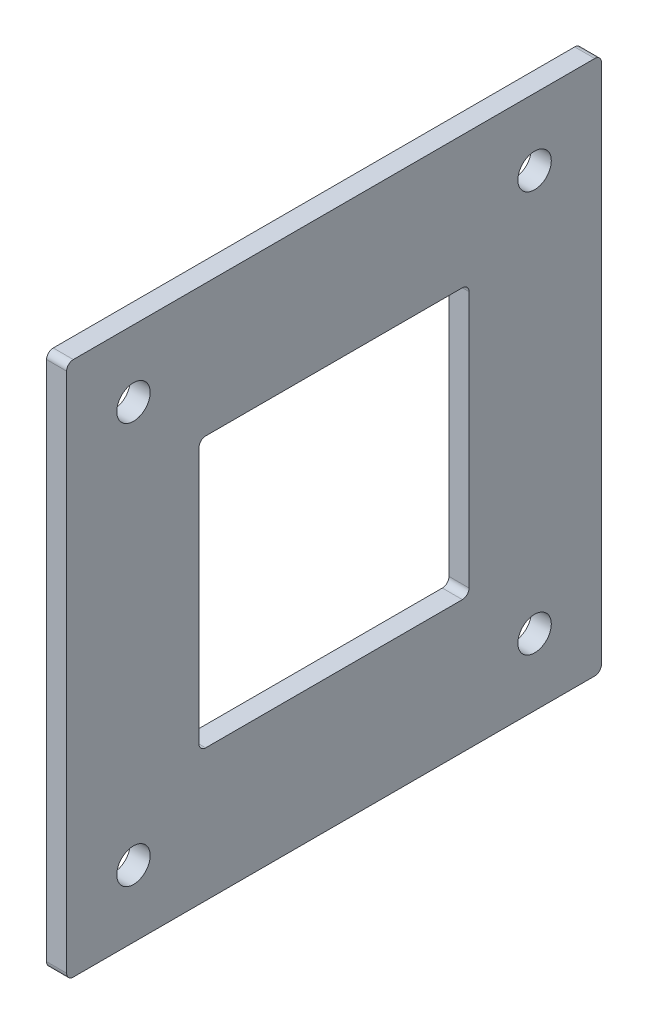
ISO-10303-21;
HEADER;
FILE_DESCRIPTION(('STEP AP214'),'2;1');
FILE_NAME('part.step','',(''),(''),'','','');
FILE_SCHEMA(('AUTOMOTIVE_DESIGN { 1 0 10303 214 1 1 1 1 }'));
ENDSEC;
DATA;
#1=APPLICATION_CONTEXT('core data for automotive mechanical design processes');
#2=APPLICATION_PROTOCOL_DEFINITION('international standard','automotive_design',2000,#1);
#3=PRODUCT_CONTEXT('',#1,'mechanical');
#4=PRODUCT('Part','Part','',(#3));
#5=PRODUCT_RELATED_PRODUCT_CATEGORY('part','',(#4));
#6=PRODUCT_DEFINITION_FORMATION('','',#4);
#7=PRODUCT_DEFINITION_CONTEXT('part definition',#1,'design');
#8=PRODUCT_DEFINITION('design','',#6,#7);
#9=PRODUCT_DEFINITION_SHAPE('','',#8);
#10=(LENGTH_UNIT() NAMED_UNIT(*) SI_UNIT(.MILLI.,.METRE.));
#11=(NAMED_UNIT(*) PLANE_ANGLE_UNIT() SI_UNIT($,.RADIAN.));
#12=(NAMED_UNIT(*) SI_UNIT($,.STERADIAN.) SOLID_ANGLE_UNIT());
#13=UNCERTAINTY_MEASURE_WITH_UNIT(LENGTH_MEASURE(1.E-05),#10,'distance_accuracy_value','');
#14=(GEOMETRIC_REPRESENTATION_CONTEXT(3) GLOBAL_UNCERTAINTY_ASSIGNED_CONTEXT((#13)) GLOBAL_UNIT_ASSIGNED_CONTEXT((#10,
#11,#12)) REPRESENTATION_CONTEXT('',''));
#15=CARTESIAN_POINT('',(0.,0.,0.));
#16=DIRECTION('',(0.,0.,1.));
#17=DIRECTION('',(1.,0.,0.));
#18=AXIS2_PLACEMENT_3D('',#15,#16,#17);
#19=CARTESIAN_POINT('',(0.,0.,0.));
#20=DIRECTION('',(-1.,0.,0.));
#21=DIRECTION('',(0.,0.,1.));
#22=AXIS2_PLACEMENT_3D('',#19,#20,#21);
#23=PLANE('',#22);
#24=CARTESIAN_POINT('',(0.,30.,30.));
#25=DIRECTION('',(1.,0.,0.));
#26=DIRECTION('',(0.,0.,-1.));
#27=AXIS2_PLACEMENT_3D('',#24,#25,#26);
#28=CIRCLE('',#27,2.49999999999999);
#29=CARTESIAN_POINT('',(0.,30.,27.5));
#30=VERTEX_POINT('',#29);
#31=EDGE_CURVE('E588',#30,#30,#28,.T.);
#32=ORIENTED_EDGE('',*,*,#31,.F.);
#33=EDGE_LOOP('',(#32));
#34=FACE_BOUND('',#33,.T.);
#35=CARTESIAN_POINT('',(0.,30.,-30.));
#36=DIRECTION('',(1.,0.,0.));
#37=DIRECTION('',(0.,0.,-1.));
#38=AXIS2_PLACEMENT_3D('',#35,#36,#37);
#39=CIRCLE('',#38,2.49999999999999);
#40=CARTESIAN_POINT('',(0.,30.,-32.5));
#41=VERTEX_POINT('',#40);
#42=EDGE_CURVE('E584',#41,#41,#39,.T.);
#43=ORIENTED_EDGE('',*,*,#42,.F.);
#44=EDGE_LOOP('',(#43));
#45=FACE_BOUND('',#44,.T.);
#46=DIRECTION('',(0.,0.,-1.));
#47=VECTOR('',#46,1.);
#48=CARTESIAN_POINT('',(0.,-40.,40.));
#49=LINE('',#48,#47);
#50=CARTESIAN_POINT('',(0.,-40.,39.));
#51=VERTEX_POINT('',#50);
#52=CARTESIAN_POINT('',(0.,-40.,-39.));
#53=VERTEX_POINT('',#52);
#54=EDGE_CURVE('E163',#51,#53,#49,.T.);
#55=ORIENTED_EDGE('',*,*,#54,.T.);
#56=CARTESIAN_POINT('',(0.,-39.,-39.));
#57=DIRECTION('',(-1.,0.,0.));
#58=DIRECTION('',(0.,0.,1.));
#59=AXIS2_PLACEMENT_3D('',#56,#57,#58);
#60=CIRCLE('',#59,1.);
#61=CARTESIAN_POINT('',(0.,-39.,-40.));
#62=VERTEX_POINT('',#61);
#63=EDGE_CURVE('E170',#53,#62,#60,.F.);
#64=ORIENTED_EDGE('',*,*,#63,.T.);
#65=DIRECTION('',(0.,1.,0.));
#66=VECTOR('',#65,1.);
#67=CARTESIAN_POINT('',(0.,-40.,-40.));
#68=LINE('',#67,#66);
#69=CARTESIAN_POINT('',(0.,39.,-40.));
#70=VERTEX_POINT('',#69);
#71=EDGE_CURVE('E280',#62,#70,#68,.T.);
#72=ORIENTED_EDGE('',*,*,#71,.T.);
#73=CARTESIAN_POINT('',(0.,39.,-39.));
#74=DIRECTION('',(-1.,0.,0.));
#75=DIRECTION('',(0.,0.,1.));
#76=AXIS2_PLACEMENT_3D('',#73,#74,#75);
#77=CIRCLE('',#76,1.);
#78=CARTESIAN_POINT('',(0.,40.,-39.));
#79=VERTEX_POINT('',#78);
#80=EDGE_CURVE('E188',#70,#79,#77,.F.);
#81=ORIENTED_EDGE('',*,*,#80,.T.);
#82=DIRECTION('',(0.,0.,1.));
#83=VECTOR('',#82,1.);
#84=CARTESIAN_POINT('',(0.,40.,40.));
#85=LINE('',#84,#83);
#86=CARTESIAN_POINT('',(0.,40.,39.));
#87=VERTEX_POINT('',#86);
#88=EDGE_CURVE('E296',#79,#87,#85,.T.);
#89=ORIENTED_EDGE('',*,*,#88,.T.);
#90=CARTESIAN_POINT('',(0.,39.,39.));
#91=DIRECTION('',(-1.,0.,0.));
#92=DIRECTION('',(0.,0.,1.));
#93=AXIS2_PLACEMENT_3D('',#90,#91,#92);
#94=CIRCLE('',#93,1.);
#95=CARTESIAN_POINT('',(0.,39.,40.));
#96=VERTEX_POINT('',#95);
#97=EDGE_CURVE('E171',#87,#96,#94,.F.);
#98=ORIENTED_EDGE('',*,*,#97,.T.);
#99=DIRECTION('',(0.,-1.,0.));
#100=VECTOR('',#99,1.);
#101=CARTESIAN_POINT('',(0.,-40.,40.));
#102=LINE('',#101,#100);
#103=CARTESIAN_POINT('',(0.,-39.,40.));
#104=VERTEX_POINT('',#103);
#105=EDGE_CURVE('E165',#96,#104,#102,.T.);
#106=ORIENTED_EDGE('',*,*,#105,.T.);
#107=CARTESIAN_POINT('',(0.,-39.,39.));
#108=DIRECTION('',(-1.,0.,0.));
#109=DIRECTION('',(0.,0.,1.));
#110=AXIS2_PLACEMENT_3D('',#107,#108,#109);
#111=CIRCLE('',#110,1.);
#112=EDGE_CURVE('E160',#104,#51,#111,.F.);
#113=ORIENTED_EDGE('',*,*,#112,.T.);
#114=EDGE_LOOP('',(#55,#64,#72,#81,#89,#98,#106,#113));
#115=FACE_BOUND('',#114,.T.);
#116=DIRECTION('',(0.,0.,1.));
#117=VECTOR('',#116,1.);
#118=CARTESIAN_POINT('',(0.,20.2,20.2));
#119=LINE('',#118,#117);
#120=CARTESIAN_POINT('',(0.,20.2,-19.2));
#121=VERTEX_POINT('',#120);
#122=CARTESIAN_POINT('',(0.,20.2,19.2));
#123=VERTEX_POINT('',#122);
#124=EDGE_CURVE('E282',#121,#123,#119,.T.);
#125=ORIENTED_EDGE('',*,*,#124,.F.);
#126=CARTESIAN_POINT('',(0.,19.2,-19.2));
#127=DIRECTION('',(-1.,0.,0.));
#128=DIRECTION('',(0.,0.,1.));
#129=AXIS2_PLACEMENT_3D('',#126,#127,#128);
#130=CIRCLE('',#129,1.);
#131=CARTESIAN_POINT('',(0.,19.2,-20.2));
#132=VERTEX_POINT('',#131);
#133=EDGE_CURVE('E245',#121,#132,#130,.T.);
#134=ORIENTED_EDGE('',*,*,#133,.T.);
#135=DIRECTION('',(0.,1.,0.));
#136=VECTOR('',#135,1.);
#137=CARTESIAN_POINT('',(0.,-20.2,-20.2));
#138=LINE('',#137,#136);
#139=CARTESIAN_POINT('',(0.,-19.2,-20.2));
#140=VERTEX_POINT('',#139);
#141=EDGE_CURVE('E254',#140,#132,#138,.T.);
#142=ORIENTED_EDGE('',*,*,#141,.F.);
#143=CARTESIAN_POINT('',(0.,-19.2,-19.2));
#144=DIRECTION('',(-1.,0.,0.));
#145=DIRECTION('',(0.,0.,1.));
#146=AXIS2_PLACEMENT_3D('',#143,#144,#145);
#147=CIRCLE('',#146,1.);
#148=CARTESIAN_POINT('',(0.,-20.2,-19.2));
#149=VERTEX_POINT('',#148);
#150=EDGE_CURVE('E55',#140,#149,#147,.T.);
#151=ORIENTED_EDGE('',*,*,#150,.T.);
#152=DIRECTION('',(0.,0.,-1.));
#153=VECTOR('',#152,1.);
#154=CARTESIAN_POINT('',(0.,-20.2,20.2));
#155=LINE('',#154,#153);
#156=CARTESIAN_POINT('',(0.,-20.2,19.2));
#157=VERTEX_POINT('',#156);
#158=EDGE_CURVE('E253',#157,#149,#155,.T.);
#159=ORIENTED_EDGE('',*,*,#158,.F.);
#160=CARTESIAN_POINT('',(0.,-19.2,19.2));
#161=DIRECTION('',(-1.,0.,0.));
#162=DIRECTION('',(0.,0.,1.));
#163=AXIS2_PLACEMENT_3D('',#160,#161,#162);
#164=CIRCLE('',#163,1.);
#165=CARTESIAN_POINT('',(0.,-19.2,20.2));
#166=VERTEX_POINT('',#165);
#167=EDGE_CURVE('E237',#157,#166,#164,.T.);
#168=ORIENTED_EDGE('',*,*,#167,.T.);
#169=DIRECTION('',(0.,-1.,0.));
#170=VECTOR('',#169,1.);
#171=CARTESIAN_POINT('',(0.,-20.2,20.2));
#172=LINE('',#171,#170);
#173=CARTESIAN_POINT('',(0.,19.2,20.2));
#174=VERTEX_POINT('',#173);
#175=EDGE_CURVE('E263',#174,#166,#172,.T.);
#176=ORIENTED_EDGE('',*,*,#175,.F.);
#177=CARTESIAN_POINT('',(0.,19.2,19.2));
#178=DIRECTION('',(-1.,0.,0.));
#179=DIRECTION('',(0.,0.,1.));
#180=AXIS2_PLACEMENT_3D('',#177,#178,#179);
#181=CIRCLE('',#180,1.);
#182=EDGE_CURVE('E241',#174,#123,#181,.T.);
#183=ORIENTED_EDGE('',*,*,#182,.T.);
#184=EDGE_LOOP('',(#125,#134,#142,#151,#159,#168,#176,#183));
#185=FACE_BOUND('',#184,.T.);
#186=CARTESIAN_POINT('',(0.,-30.,30.));
#187=DIRECTION('',(1.,0.,0.));
#188=DIRECTION('',(0.,0.,-1.));
#189=AXIS2_PLACEMENT_3D('',#186,#187,#188);
#190=CIRCLE('',#189,2.49999999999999);
#191=CARTESIAN_POINT('',(0.,-30.,27.5));
#192=VERTEX_POINT('',#191);
#193=EDGE_CURVE('E575',#192,#192,#190,.T.);
#194=ORIENTED_EDGE('',*,*,#193,.F.);
#195=EDGE_LOOP('',(#194));
#196=FACE_BOUND('',#195,.T.);
#197=CARTESIAN_POINT('',(0.,-30.,-30.));
#198=DIRECTION('',(1.,0.,0.));
#199=DIRECTION('',(0.,0.,-1.));
#200=AXIS2_PLACEMENT_3D('',#197,#198,#199);
#201=CIRCLE('',#200,2.49999999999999);
#202=CARTESIAN_POINT('',(0.,-30.,-32.5));
#203=VERTEX_POINT('',#202);
#204=EDGE_CURVE('E578',#203,#203,#201,.T.);
#205=ORIENTED_EDGE('',*,*,#204,.F.);
#206=EDGE_LOOP('',(#205));
#207=FACE_BOUND('',#206,.T.);
#208=ADVANCED_FACE('F47',(#34,#45,#115,#185,#196,#207),#23,.F.);
#209=CARTESIAN_POINT('',(-3.,-40.,-40.));
#210=DIRECTION('',(0.,0.,-1.));
#211=DIRECTION('',(-1.,0.,0.));
#212=AXIS2_PLACEMENT_3D('',#209,#210,#211);
#213=PLANE('',#212);
#214=ORIENTED_EDGE('',*,*,#71,.F.);
#215=DIRECTION('',(1.,0.,0.));
#216=VECTOR('',#215,1.);
#217=CARTESIAN_POINT('',(-3.,-39.,-40.));
#218=LINE('',#217,#216);
#219=CARTESIAN_POINT('',(-3.,-39.,-40.));
#220=VERTEX_POINT('',#219);
#221=EDGE_CURVE('E200',#62,#220,#218,.F.);
#222=ORIENTED_EDGE('',*,*,#221,.T.);
#223=DIRECTION('',(0.,1.,0.));
#224=VECTOR('',#223,1.);
#225=CARTESIAN_POINT('',(-3.,-40.,-40.));
#226=LINE('',#225,#224);
#227=CARTESIAN_POINT('',(-3.,39.,-40.));
#228=VERTEX_POINT('',#227);
#229=EDGE_CURVE('E181',#220,#228,#226,.T.);
#230=ORIENTED_EDGE('',*,*,#229,.T.);
#231=DIRECTION('',(1.,0.,0.));
#232=VECTOR('',#231,1.);
#233=CARTESIAN_POINT('',(-3.,39.,-40.));
#234=LINE('',#233,#232);
#235=EDGE_CURVE('E197',#228,#70,#234,.T.);
#236=ORIENTED_EDGE('',*,*,#235,.T.);
#237=EDGE_LOOP('',(#214,#222,#230,#236));
#238=FACE_BOUND('',#237,.T.);
#239=ADVANCED_FACE('F314',(#238),#213,.T.);
#240=CARTESIAN_POINT('',(-3.,-40.,40.));
#241=DIRECTION('',(0.,-1.,0.));
#242=DIRECTION('',(0.,0.,-1.));
#243=AXIS2_PLACEMENT_3D('',#240,#241,#242);
#244=PLANE('',#243);
#245=DIRECTION('',(0.,0.,-1.));
#246=VECTOR('',#245,1.);
#247=CARTESIAN_POINT('',(-3.,-40.,40.));
#248=LINE('',#247,#246);
#249=CARTESIAN_POINT('',(-3.,-40.,39.));
#250=VERTEX_POINT('',#249);
#251=CARTESIAN_POINT('',(-3.,-40.,-39.));
#252=VERTEX_POINT('',#251);
#253=EDGE_CURVE('E186',#250,#252,#248,.T.);
#254=ORIENTED_EDGE('',*,*,#253,.T.);
#255=DIRECTION('',(1.,0.,0.));
#256=VECTOR('',#255,1.);
#257=CARTESIAN_POINT('',(-3.,-40.,-39.));
#258=LINE('',#257,#256);
#259=EDGE_CURVE('E180',#252,#53,#258,.T.);
#260=ORIENTED_EDGE('',*,*,#259,.T.);
#261=ORIENTED_EDGE('',*,*,#54,.F.);
#262=DIRECTION('',(1.,0.,0.));
#263=VECTOR('',#262,1.);
#264=CARTESIAN_POINT('',(-3.,-40.,39.));
#265=LINE('',#264,#263);
#266=EDGE_CURVE('E177',#51,#250,#265,.F.);
#267=ORIENTED_EDGE('',*,*,#266,.T.);
#268=EDGE_LOOP('',(#254,#260,#261,#267));
#269=FACE_BOUND('',#268,.T.);
#270=ADVANCED_FACE('F176',(#269),#244,.T.);
#271=CARTESIAN_POINT('',(-3.,-40.,40.));
#272=DIRECTION('',(0.,0.,1.));
#273=DIRECTION('',(1.,0.,0.));
#274=AXIS2_PLACEMENT_3D('',#271,#272,#273);
#275=PLANE('',#274);
#276=DIRECTION('',(0.,-1.,0.));
#277=VECTOR('',#276,1.);
#278=CARTESIAN_POINT('',(-3.,-40.,40.));
#279=LINE('',#278,#277);
#280=CARTESIAN_POINT('',(-3.,39.,40.));
#281=VERTEX_POINT('',#280);
#282=CARTESIAN_POINT('',(-3.,-39.,40.));
#283=VERTEX_POINT('',#282);
#284=EDGE_CURVE('E190',#281,#283,#279,.T.);
#285=ORIENTED_EDGE('',*,*,#284,.T.);
#286=DIRECTION('',(1.,0.,0.));
#287=VECTOR('',#286,1.);
#288=CARTESIAN_POINT('',(-3.,-39.,40.));
#289=LINE('',#288,#287);
#290=EDGE_CURVE('E211',#283,#104,#289,.T.);
#291=ORIENTED_EDGE('',*,*,#290,.T.);
#292=ORIENTED_EDGE('',*,*,#105,.F.);
#293=DIRECTION('',(1.,0.,0.));
#294=VECTOR('',#293,1.);
#295=CARTESIAN_POINT('',(-3.,39.,40.));
#296=LINE('',#295,#294);
#297=EDGE_CURVE('E209',#96,#281,#296,.F.);
#298=ORIENTED_EDGE('',*,*,#297,.T.);
#299=EDGE_LOOP('',(#285,#291,#292,#298));
#300=FACE_BOUND('',#299,.T.);
#301=ADVANCED_FACE('F321',(#300),#275,.T.);
#302=CARTESIAN_POINT('',(-3.,40.,40.));
#303=DIRECTION('',(0.,1.,0.));
#304=DIRECTION('',(0.,0.,1.));
#305=AXIS2_PLACEMENT_3D('',#302,#303,#304);
#306=PLANE('',#305);
#307=DIRECTION('',(0.,0.,1.));
#308=VECTOR('',#307,1.);
#309=CARTESIAN_POINT('',(-3.,40.,40.));
#310=LINE('',#309,#308);
#311=CARTESIAN_POINT('',(-3.,40.,-39.));
#312=VERTEX_POINT('',#311);
#313=CARTESIAN_POINT('',(-3.,40.,39.));
#314=VERTEX_POINT('',#313);
#315=EDGE_CURVE('E289',#312,#314,#310,.T.);
#316=ORIENTED_EDGE('',*,*,#315,.T.);
#317=DIRECTION('',(1.,0.,0.));
#318=VECTOR('',#317,1.);
#319=CARTESIAN_POINT('',(-3.,40.,39.));
#320=LINE('',#319,#318);
#321=EDGE_CURVE('E215',#314,#87,#320,.T.);
#322=ORIENTED_EDGE('',*,*,#321,.T.);
#323=ORIENTED_EDGE('',*,*,#88,.F.);
#324=DIRECTION('',(1.,0.,0.));
#325=VECTOR('',#324,1.);
#326=CARTESIAN_POINT('',(-3.,40.,-39.));
#327=LINE('',#326,#325);
#328=EDGE_CURVE('E213',#79,#312,#327,.F.);
#329=ORIENTED_EDGE('',*,*,#328,.T.);
#330=EDGE_LOOP('',(#316,#322,#323,#329));
#331=FACE_BOUND('',#330,.T.);
#332=ADVANCED_FACE('F301',(#331),#306,.T.);
#333=CARTESIAN_POINT('',(-3.,0.,0.));
#334=DIRECTION('',(-1.,0.,0.));
#335=DIRECTION('',(0.,0.,1.));
#336=AXIS2_PLACEMENT_3D('',#333,#334,#335);
#337=PLANE('',#336);
#338=CARTESIAN_POINT('',(-3.,30.,30.));
#339=DIRECTION('',(-1.,0.,0.));
#340=DIRECTION('',(0.,0.,1.));
#341=AXIS2_PLACEMENT_3D('',#338,#339,#340);
#342=CIRCLE('',#341,2.5);
#343=CARTESIAN_POINT('',(-3.,30.,32.5));
#344=VERTEX_POINT('',#343);
#345=EDGE_CURVE('E395',#344,#344,#342,.T.);
#346=ORIENTED_EDGE('',*,*,#345,.F.);
#347=EDGE_LOOP('',(#346));
#348=FACE_BOUND('',#347,.T.);
#349=CARTESIAN_POINT('',(-3.,30.,-30.));
#350=DIRECTION('',(-1.,0.,0.));
#351=DIRECTION('',(0.,0.,1.));
#352=AXIS2_PLACEMENT_3D('',#349,#350,#351);
#353=CIRCLE('',#352,2.5);
#354=CARTESIAN_POINT('',(-3.,30.,-27.5));
#355=VERTEX_POINT('',#354);
#356=EDGE_CURVE('E399',#355,#355,#353,.T.);
#357=ORIENTED_EDGE('',*,*,#356,.F.);
#358=EDGE_LOOP('',(#357));
#359=FACE_BOUND('',#358,.T.);
#360=CARTESIAN_POINT('',(-3.,-30.,-30.));
#361=DIRECTION('',(-1.,0.,0.));
#362=DIRECTION('',(0.,0.,1.));
#363=AXIS2_PLACEMENT_3D('',#360,#361,#362);
#364=CIRCLE('',#363,2.49999999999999);
#365=CARTESIAN_POINT('',(-3.,-30.,-27.5));
#366=VERTEX_POINT('',#365);
#367=EDGE_CURVE('E403',#366,#366,#364,.T.);
#368=ORIENTED_EDGE('',*,*,#367,.F.);
#369=EDGE_LOOP('',(#368));
#370=FACE_BOUND('',#369,.T.);
#371=CARTESIAN_POINT('',(-3.,-30.,30.));
#372=DIRECTION('',(-1.,0.,0.));
#373=DIRECTION('',(0.,0.,1.));
#374=AXIS2_PLACEMENT_3D('',#371,#372,#373);
#375=CIRCLE('',#374,2.49999999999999);
#376=CARTESIAN_POINT('',(-3.,-30.,32.5));
#377=VERTEX_POINT('',#376);
#378=EDGE_CURVE('E273',#377,#377,#375,.T.);
#379=ORIENTED_EDGE('',*,*,#378,.F.);
#380=EDGE_LOOP('',(#379));
#381=FACE_BOUND('',#380,.T.);
#382=DIRECTION('',(0.,0.,-1.));
#383=VECTOR('',#382,1.);
#384=CARTESIAN_POINT('',(-3.,-20.2,20.2));
#385=LINE('',#384,#383);
#386=CARTESIAN_POINT('',(-3.,-20.2,19.2));
#387=VERTEX_POINT('',#386);
#388=CARTESIAN_POINT('',(-3.,-20.2,-19.2));
#389=VERTEX_POINT('',#388);
#390=EDGE_CURVE('E278',#387,#389,#385,.T.);
#391=ORIENTED_EDGE('',*,*,#390,.T.);
#392=CARTESIAN_POINT('',(-3.,-19.2,-19.2));
#393=DIRECTION('',(-1.,0.,0.));
#394=DIRECTION('',(0.,0.,1.));
#395=AXIS2_PLACEMENT_3D('',#392,#393,#394);
#396=CIRCLE('',#395,1.);
#397=CARTESIAN_POINT('',(-3.,-19.2,-20.2));
#398=VERTEX_POINT('',#397);
#399=EDGE_CURVE('E13',#389,#398,#396,.F.);
#400=ORIENTED_EDGE('',*,*,#399,.T.);
#401=DIRECTION('',(0.,1.,0.));
#402=VECTOR('',#401,1.);
#403=CARTESIAN_POINT('',(-3.,-20.2,-20.2));
#404=LINE('',#403,#402);
#405=CARTESIAN_POINT('',(-3.,19.2,-20.2));
#406=VERTEX_POINT('',#405);
#407=EDGE_CURVE('E262',#398,#406,#404,.T.);
#408=ORIENTED_EDGE('',*,*,#407,.T.);
#409=CARTESIAN_POINT('',(-3.,19.2,-19.2));
#410=DIRECTION('',(-1.,0.,0.));
#411=DIRECTION('',(0.,0.,1.));
#412=AXIS2_PLACEMENT_3D('',#409,#410,#411);
#413=CIRCLE('',#412,1.);
#414=CARTESIAN_POINT('',(-3.,20.2,-19.2));
#415=VERTEX_POINT('',#414);
#416=EDGE_CURVE('E247',#406,#415,#413,.F.);
#417=ORIENTED_EDGE('',*,*,#416,.T.);
#418=DIRECTION('',(0.,0.,1.));
#419=VECTOR('',#418,1.);
#420=CARTESIAN_POINT('',(-3.,20.2,20.2));
#421=LINE('',#420,#419);
#422=CARTESIAN_POINT('',(-3.,20.2,19.2));
#423=VERTEX_POINT('',#422);
#424=EDGE_CURVE('E267',#415,#423,#421,.T.);
#425=ORIENTED_EDGE('',*,*,#424,.T.);
#426=CARTESIAN_POINT('',(-3.,19.2,19.2));
#427=DIRECTION('',(-1.,0.,0.));
#428=DIRECTION('',(0.,0.,1.));
#429=AXIS2_PLACEMENT_3D('',#426,#427,#428);
#430=CIRCLE('',#429,1.);
#431=CARTESIAN_POINT('',(-3.,19.2,20.2));
#432=VERTEX_POINT('',#431);
#433=EDGE_CURVE('E243',#423,#432,#430,.F.);
#434=ORIENTED_EDGE('',*,*,#433,.T.);
#435=DIRECTION('',(0.,-1.,0.));
#436=VECTOR('',#435,1.);
#437=CARTESIAN_POINT('',(-3.,-20.2,20.2));
#438=LINE('',#437,#436);
#439=CARTESIAN_POINT('',(-3.,-19.2,20.2));
#440=VERTEX_POINT('',#439);
#441=EDGE_CURVE('E270',#432,#440,#438,.T.);
#442=ORIENTED_EDGE('',*,*,#441,.T.);
#443=CARTESIAN_POINT('',(-3.,-19.2,19.2));
#444=DIRECTION('',(-1.,0.,0.));
#445=DIRECTION('',(0.,0.,1.));
#446=AXIS2_PLACEMENT_3D('',#443,#444,#445);
#447=CIRCLE('',#446,1.);
#448=EDGE_CURVE('E239',#440,#387,#447,.F.);
#449=ORIENTED_EDGE('',*,*,#448,.T.);
#450=EDGE_LOOP('',(#391,#400,#408,#417,#425,#434,#442,#449));
#451=FACE_BOUND('',#450,.T.);
#452=ORIENTED_EDGE('',*,*,#229,.F.);
#453=CARTESIAN_POINT('',(-3.,-39.,-39.));
#454=DIRECTION('',(-1.,0.,0.));
#455=DIRECTION('',(0.,0.,1.));
#456=AXIS2_PLACEMENT_3D('',#453,#454,#455);
#457=CIRCLE('',#456,1.);
#458=EDGE_CURVE('E207',#220,#252,#457,.T.);
#459=ORIENTED_EDGE('',*,*,#458,.T.);
#460=ORIENTED_EDGE('',*,*,#253,.F.);
#461=CARTESIAN_POINT('',(-3.,-39.,39.));
#462=DIRECTION('',(-1.,0.,0.));
#463=DIRECTION('',(0.,0.,1.));
#464=AXIS2_PLACEMENT_3D('',#461,#462,#463);
#465=CIRCLE('',#464,1.);
#466=EDGE_CURVE('E185',#250,#283,#465,.T.);
#467=ORIENTED_EDGE('',*,*,#466,.T.);
#468=ORIENTED_EDGE('',*,*,#284,.F.);
#469=CARTESIAN_POINT('',(-3.,39.,39.));
#470=DIRECTION('',(-1.,0.,0.));
#471=DIRECTION('',(0.,0.,1.));
#472=AXIS2_PLACEMENT_3D('',#469,#470,#471);
#473=CIRCLE('',#472,1.);
#474=EDGE_CURVE('E204',#281,#314,#473,.T.);
#475=ORIENTED_EDGE('',*,*,#474,.T.);
#476=ORIENTED_EDGE('',*,*,#315,.F.);
#477=CARTESIAN_POINT('',(-3.,39.,-39.));
#478=DIRECTION('',(-1.,0.,0.));
#479=DIRECTION('',(0.,0.,1.));
#480=AXIS2_PLACEMENT_3D('',#477,#478,#479);
#481=CIRCLE('',#480,1.);
#482=EDGE_CURVE('E202',#312,#228,#481,.T.);
#483=ORIENTED_EDGE('',*,*,#482,.T.);
#484=EDGE_LOOP('',(#452,#459,#460,#467,#468,#475,#476,#483));
#485=FACE_BOUND('',#484,.T.);
#486=ADVANCED_FACE('F310',(#348,#359,#370,#381,#451,#485),#337,.T.);
#487=CARTESIAN_POINT('',(-3.,-20.2,-20.2));
#488=DIRECTION('',(0.,0.,-1.));
#489=DIRECTION('',(-1.,0.,0.));
#490=AXIS2_PLACEMENT_3D('',#487,#488,#489);
#491=PLANE('',#490);
#492=ORIENTED_EDGE('',*,*,#141,.T.);
#493=DIRECTION('',(1.,0.,0.));
#494=VECTOR('',#493,1.);
#495=CARTESIAN_POINT('',(-3.,19.2,-20.2));
#496=LINE('',#495,#494);
#497=EDGE_CURVE('E62',#132,#406,#496,.F.);
#498=ORIENTED_EDGE('',*,*,#497,.T.);
#499=ORIENTED_EDGE('',*,*,#407,.F.);
#500=DIRECTION('',(1.,0.,0.));
#501=VECTOR('',#500,1.);
#502=CARTESIAN_POINT('',(0.,-19.2,-20.2));
#503=LINE('',#502,#501);
#504=EDGE_CURVE('E233',#398,#140,#503,.T.);
#505=ORIENTED_EDGE('',*,*,#504,.T.);
#506=EDGE_LOOP('',(#492,#498,#499,#505));
#507=FACE_BOUND('',#506,.T.);
#508=ADVANCED_FACE('F265',(#507),#491,.F.);
#509=CARTESIAN_POINT('',(-3.,-20.2,20.2));
#510=DIRECTION('',(0.,-1.,0.));
#511=DIRECTION('',(0.,0.,-1.));
#512=AXIS2_PLACEMENT_3D('',#509,#510,#511);
#513=PLANE('',#512);
#514=ORIENTED_EDGE('',*,*,#390,.F.);
#515=DIRECTION('',(1.,0.,0.));
#516=VECTOR('',#515,1.);
#517=CARTESIAN_POINT('',(0.,-20.2,19.2));
#518=LINE('',#517,#516);
#519=EDGE_CURVE('E220',#387,#157,#518,.T.);
#520=ORIENTED_EDGE('',*,*,#519,.T.);
#521=ORIENTED_EDGE('',*,*,#158,.T.);
#522=DIRECTION('',(1.,0.,0.));
#523=VECTOR('',#522,1.);
#524=CARTESIAN_POINT('',(-3.,-20.2,-19.2));
#525=LINE('',#524,#523);
#526=EDGE_CURVE('E218',#149,#389,#525,.F.);
#527=ORIENTED_EDGE('',*,*,#526,.T.);
#528=EDGE_LOOP('',(#514,#520,#521,#527));
#529=FACE_BOUND('',#528,.T.);
#530=ADVANCED_FACE('F260',(#529),#513,.F.);
#531=CARTESIAN_POINT('',(-3.,-20.2,20.2));
#532=DIRECTION('',(0.,0.,1.));
#533=DIRECTION('',(1.,0.,0.));
#534=AXIS2_PLACEMENT_3D('',#531,#532,#533);
#535=PLANE('',#534);
#536=ORIENTED_EDGE('',*,*,#175,.T.);
#537=DIRECTION('',(1.,0.,0.));
#538=VECTOR('',#537,1.);
#539=CARTESIAN_POINT('',(-3.,-19.2,20.2));
#540=LINE('',#539,#538);
#541=EDGE_CURVE('E226',#166,#440,#540,.F.);
#542=ORIENTED_EDGE('',*,*,#541,.T.);
#543=ORIENTED_EDGE('',*,*,#441,.F.);
#544=DIRECTION('',(1.,0.,0.));
#545=VECTOR('',#544,1.);
#546=CARTESIAN_POINT('',(0.,19.2,20.2));
#547=LINE('',#546,#545);
#548=EDGE_CURVE('E223',#432,#174,#547,.T.);
#549=ORIENTED_EDGE('',*,*,#548,.T.);
#550=EDGE_LOOP('',(#536,#542,#543,#549));
#551=FACE_BOUND('',#550,.T.);
#552=ADVANCED_FACE('F379',(#551),#535,.F.);
#553=CARTESIAN_POINT('',(-3.,20.2,20.2));
#554=DIRECTION('',(0.,1.,0.));
#555=DIRECTION('',(0.,0.,1.));
#556=AXIS2_PLACEMENT_3D('',#553,#554,#555);
#557=PLANE('',#556);
#558=ORIENTED_EDGE('',*,*,#124,.T.);
#559=DIRECTION('',(1.,0.,0.));
#560=VECTOR('',#559,1.);
#561=CARTESIAN_POINT('',(-3.,20.2,19.2));
#562=LINE('',#561,#560);
#563=EDGE_CURVE('E231',#123,#423,#562,.F.);
#564=ORIENTED_EDGE('',*,*,#563,.T.);
#565=ORIENTED_EDGE('',*,*,#424,.F.);
#566=DIRECTION('',(1.,0.,0.));
#567=VECTOR('',#566,1.);
#568=CARTESIAN_POINT('',(0.,20.2,-19.2));
#569=LINE('',#568,#567);
#570=EDGE_CURVE('E228',#415,#121,#569,.T.);
#571=ORIENTED_EDGE('',*,*,#570,.T.);
#572=EDGE_LOOP('',(#558,#564,#565,#571));
#573=FACE_BOUND('',#572,.T.);
#574=ADVANCED_FACE('F375',(#573),#557,.F.);
#575=CARTESIAN_POINT('',(0.,-30.,30.));
#576=DIRECTION('',(1.,0.,0.));
#577=DIRECTION('',(0.,0.,-1.));
#578=AXIS2_PLACEMENT_3D('',#575,#576,#577);
#579=CYLINDRICAL_SURFACE('',#578,2.49999999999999);
#580=ORIENTED_EDGE('',*,*,#193,.T.);
#581=EDGE_LOOP('',(#580));
#582=FACE_BOUND('',#581,.T.);
#583=ORIENTED_EDGE('',*,*,#378,.T.);
#584=EDGE_LOOP('',(#583));
#585=FACE_BOUND('',#584,.T.);
#586=ADVANCED_FACE('F371',(#582,#585),#579,.F.);
#587=CARTESIAN_POINT('',(0.,-30.,-30.));
#588=DIRECTION('',(1.,0.,0.));
#589=DIRECTION('',(0.,0.,-1.));
#590=AXIS2_PLACEMENT_3D('',#587,#588,#589);
#591=CYLINDRICAL_SURFACE('',#590,2.49999999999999);
#592=ORIENTED_EDGE('',*,*,#204,.T.);
#593=EDGE_LOOP('',(#592));
#594=FACE_BOUND('',#593,.T.);
#595=ORIENTED_EDGE('',*,*,#367,.T.);
#596=EDGE_LOOP('',(#595));
#597=FACE_BOUND('',#596,.T.);
#598=ADVANCED_FACE('F363',(#594,#597),#591,.F.);
#599=CARTESIAN_POINT('',(0.,30.,-30.));
#600=DIRECTION('',(1.,0.,0.));
#601=DIRECTION('',(0.,0.,-1.));
#602=AXIS2_PLACEMENT_3D('',#599,#600,#601);
#603=CYLINDRICAL_SURFACE('',#602,2.5);
#604=ORIENTED_EDGE('',*,*,#42,.T.);
#605=EDGE_LOOP('',(#604));
#606=FACE_BOUND('',#605,.T.);
#607=ORIENTED_EDGE('',*,*,#356,.T.);
#608=EDGE_LOOP('',(#607));
#609=FACE_BOUND('',#608,.T.);
#610=ADVANCED_FACE('F357',(#606,#609),#603,.F.);
#611=CARTESIAN_POINT('',(0.,30.,30.));
#612=DIRECTION('',(1.,0.,0.));
#613=DIRECTION('',(0.,0.,-1.));
#614=AXIS2_PLACEMENT_3D('',#611,#612,#613);
#615=CYLINDRICAL_SURFACE('',#614,2.5);
#616=ORIENTED_EDGE('',*,*,#31,.T.);
#617=EDGE_LOOP('',(#616));
#618=FACE_BOUND('',#617,.T.);
#619=ORIENTED_EDGE('',*,*,#345,.T.);
#620=EDGE_LOOP('',(#619));
#621=FACE_BOUND('',#620,.T.);
#622=ADVANCED_FACE('F353',(#618,#621),#615,.F.);
#623=CARTESIAN_POINT('',(-3.,-39.,-39.));
#624=DIRECTION('',(1.,0.,0.));
#625=DIRECTION('',(0.,0.,-1.));
#626=AXIS2_PLACEMENT_3D('',#623,#624,#625);
#627=CYLINDRICAL_SURFACE('',#626,1.);
#628=ORIENTED_EDGE('',*,*,#458,.F.);
#629=ORIENTED_EDGE('',*,*,#221,.F.);
#630=ORIENTED_EDGE('',*,*,#63,.F.);
#631=ORIENTED_EDGE('',*,*,#259,.F.);
#632=EDGE_LOOP('',(#628,#629,#630,#631));
#633=FACE_BOUND('',#632,.T.);
#634=ADVANCED_FACE('F317',(#633),#627,.T.);
#635=CARTESIAN_POINT('',(-3.,-39.,39.));
#636=DIRECTION('',(1.,0.,0.));
#637=DIRECTION('',(0.,0.,-1.));
#638=AXIS2_PLACEMENT_3D('',#635,#636,#637);
#639=CYLINDRICAL_SURFACE('',#638,1.);
#640=ORIENTED_EDGE('',*,*,#466,.F.);
#641=ORIENTED_EDGE('',*,*,#266,.F.);
#642=ORIENTED_EDGE('',*,*,#112,.F.);
#643=ORIENTED_EDGE('',*,*,#290,.F.);
#644=EDGE_LOOP('',(#640,#641,#642,#643));
#645=FACE_BOUND('',#644,.T.);
#646=ADVANCED_FACE('F184',(#645),#639,.T.);
#647=CARTESIAN_POINT('',(-3.,39.,39.));
#648=DIRECTION('',(1.,0.,0.));
#649=DIRECTION('',(0.,0.,-1.));
#650=AXIS2_PLACEMENT_3D('',#647,#648,#649);
#651=CYLINDRICAL_SURFACE('',#650,1.);
#652=ORIENTED_EDGE('',*,*,#474,.F.);
#653=ORIENTED_EDGE('',*,*,#297,.F.);
#654=ORIENTED_EDGE('',*,*,#97,.F.);
#655=ORIENTED_EDGE('',*,*,#321,.F.);
#656=EDGE_LOOP('',(#652,#653,#654,#655));
#657=FACE_BOUND('',#656,.T.);
#658=ADVANCED_FACE('F324',(#657),#651,.T.);
#659=CARTESIAN_POINT('',(-3.,39.,-39.));
#660=DIRECTION('',(1.,0.,0.));
#661=DIRECTION('',(0.,0.,-1.));
#662=AXIS2_PLACEMENT_3D('',#659,#660,#661);
#663=CYLINDRICAL_SURFACE('',#662,1.);
#664=ORIENTED_EDGE('',*,*,#482,.F.);
#665=ORIENTED_EDGE('',*,*,#328,.F.);
#666=ORIENTED_EDGE('',*,*,#80,.F.);
#667=ORIENTED_EDGE('',*,*,#235,.F.);
#668=EDGE_LOOP('',(#664,#665,#666,#667));
#669=FACE_BOUND('',#668,.T.);
#670=ADVANCED_FACE('F306',(#669),#663,.T.);
#671=CARTESIAN_POINT('',(-3.,-19.2,19.2));
#672=DIRECTION('',(-1.,0.,0.));
#673=DIRECTION('',(0.,0.,1.));
#674=AXIS2_PLACEMENT_3D('',#671,#672,#673);
#675=CYLINDRICAL_SURFACE('',#674,1.);
#676=ORIENTED_EDGE('',*,*,#448,.F.);
#677=ORIENTED_EDGE('',*,*,#541,.F.);
#678=ORIENTED_EDGE('',*,*,#167,.F.);
#679=ORIENTED_EDGE('',*,*,#519,.F.);
#680=EDGE_LOOP('',(#676,#677,#678,#679));
#681=FACE_BOUND('',#680,.T.);
#682=ADVANCED_FACE('F331',(#681),#675,.F.);
#683=CARTESIAN_POINT('',(-3.,19.2,19.2));
#684=DIRECTION('',(-1.,0.,0.));
#685=DIRECTION('',(0.,0.,1.));
#686=AXIS2_PLACEMENT_3D('',#683,#684,#685);
#687=CYLINDRICAL_SURFACE('',#686,1.);
#688=ORIENTED_EDGE('',*,*,#433,.F.);
#689=ORIENTED_EDGE('',*,*,#563,.F.);
#690=ORIENTED_EDGE('',*,*,#182,.F.);
#691=ORIENTED_EDGE('',*,*,#548,.F.);
#692=EDGE_LOOP('',(#688,#689,#690,#691));
#693=FACE_BOUND('',#692,.T.);
#694=ADVANCED_FACE('F414',(#693),#687,.F.);
#695=CARTESIAN_POINT('',(-3.,19.2,-19.2));
#696=DIRECTION('',(-1.,0.,0.));
#697=DIRECTION('',(0.,0.,1.));
#698=AXIS2_PLACEMENT_3D('',#695,#696,#697);
#699=CYLINDRICAL_SURFACE('',#698,1.);
#700=ORIENTED_EDGE('',*,*,#416,.F.);
#701=ORIENTED_EDGE('',*,*,#497,.F.);
#702=ORIENTED_EDGE('',*,*,#133,.F.);
#703=ORIENTED_EDGE('',*,*,#570,.F.);
#704=EDGE_LOOP('',(#700,#701,#702,#703));
#705=FACE_BOUND('',#704,.T.);
#706=ADVANCED_FACE('F419',(#705),#699,.F.);
#707=CARTESIAN_POINT('',(-3.,-19.2,-19.2));
#708=DIRECTION('',(-1.,0.,0.));
#709=DIRECTION('',(0.,0.,1.));
#710=AXIS2_PLACEMENT_3D('',#707,#708,#709);
#711=CYLINDRICAL_SURFACE('',#710,1.);
#712=ORIENTED_EDGE('',*,*,#399,.F.);
#713=ORIENTED_EDGE('',*,*,#526,.F.);
#714=ORIENTED_EDGE('',*,*,#150,.F.);
#715=ORIENTED_EDGE('',*,*,#504,.F.);
#716=EDGE_LOOP('',(#712,#713,#714,#715));
#717=FACE_BOUND('',#716,.T.);
#718=ADVANCED_FACE('F49',(#717),#711,.F.);
#719=CLOSED_SHELL('',(#208,#239,#270,#301,#332,#486,#508,#530,#552,#574,#586,#598,#610,#622,
#634,#646,#658,#670,#682,#694,#706,#718));
#720=MANIFOLD_SOLID_BREP('B2',#719);
#721=ADVANCED_BREP_SHAPE_REPRESENTATION('',(#18,#720),#14);
#722=SHAPE_DEFINITION_REPRESENTATION(#9,#721);
ENDSEC;
END-ISO-10303-21;
